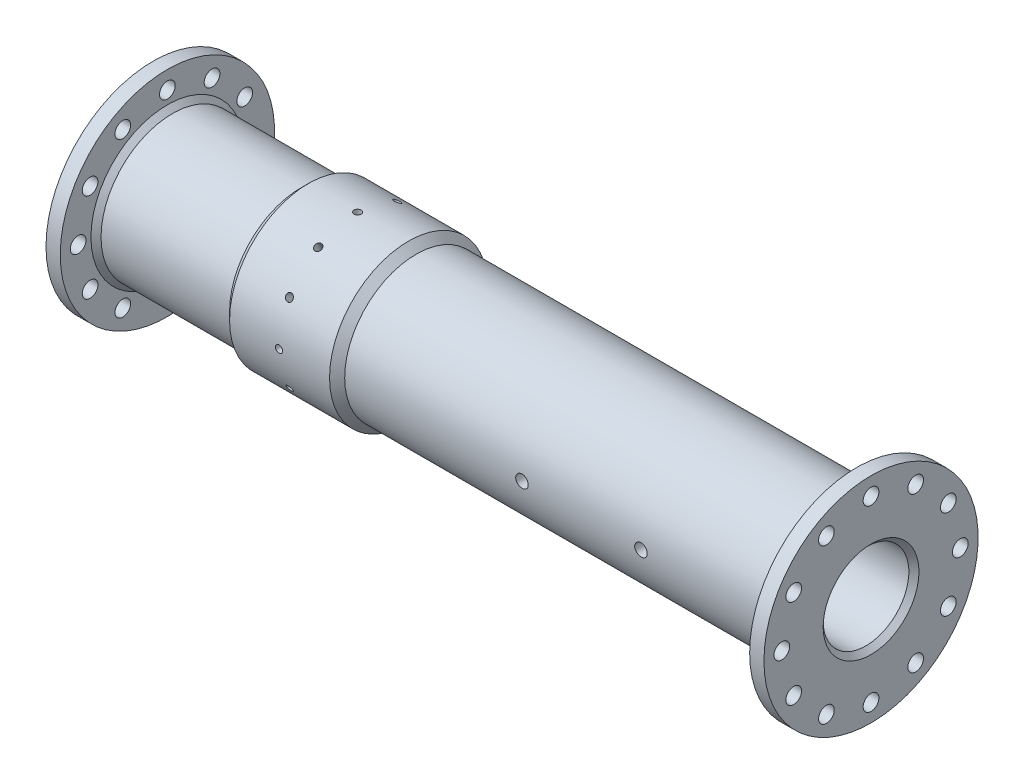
from build123d import *

# Parameters (mm, degrees)
M20_CLEARANCE_HOLE1_D                      = 22
CIRPATTERN1_COUNT                          = 12
F_10_0MM_DOWEL_HOLE1_REACH                 = 780.945
F_10_0MM_DOWEL_HOLE1_BORE_R                = 5
CIRPATTERN2_COUNT                          = 12
TAP_DRILL_FOR_M20X2_5_TAP1_REACH           = 684.255
TAP_DRILL_FOR_M20X2_5_TAP1_BORE_R          = 8.75
TAP_DRILL_FOR_M20X2_5_TAP1_ON_FACE_2_REACH = 837.883
TAP_DRILL_FOR_M20X2_5_TAP1_BORE_2_R        = 8.75


with BuildPart() as part:
    # Sketch1 → Revolve2 (revolve)
    with BuildSketch(Plane(origin=(0, 0, 0), x_dir=(1, 0, 0), z_dir=(0, 1, 0)), mode=Mode.PRIVATE) as revolve2_sk:
        with BuildLine():
            Line((0, 15.330989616), (20, 15.330989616))
            Line((20, 15.330989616), (20, -27.597942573))
            Line((20, -27.597942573), (27.071067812, -34.669010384))
            Line((27.071067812, -34.669010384), (207.071067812, -34.669010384))
            Line((207.071067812, -34.669010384), (217.67766953, -24.062408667))
            Line((217.67766953, -24.062408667), (357.67766953, -24.062408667))
            Line((357.67766953, -24.062408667), (368.284271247, -34.669010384))
            Line((368.284271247, -34.669010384), (978.284271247, -34.669010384))
            Line((978.284271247, -34.669010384), (985.355339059, -27.597942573))
            Line((985.355339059, -27.597942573), (985.355339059, 15.330989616))
            Line((985.355339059, 15.330989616), (1005.355339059, 15.330989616))
            Line((1005.355339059, 15.330989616), (1005.355339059, -67.597942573))
            Line((1005.355339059, -67.597942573), (998.284271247, -74.669010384))
            Line((998.284271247, -74.669010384), (750.395800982, -74.669010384))
            ThreePointArc((750.395800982, -74.669010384), (746.922837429, -74.972855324), (743.555398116, -75.875157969))
            Line((743.555398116, -75.875157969), (640.284027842, -113.4628628))
            ThreePointArc((640.284027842, -113.4628628), (636.916588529, -114.365165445), (633.443624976, -114.669010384))
            Line((633.443624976, -114.669010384), (600.496704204, -114.669010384))
            ThreePointArc((600.496704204, -114.669010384), (597.023740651, -114.365165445), (593.656301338, -113.4628628))
            Line((593.656301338, -113.4628628), (490.384931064, -75.875157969))
            ThreePointArc((490.384931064, -75.875157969), (487.017491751, -74.972855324), (483.544528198, -74.669010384))
            Line((483.544528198, -74.669010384), (7.071067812, -74.669010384))
            Line((7.071067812, -74.669010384), (0, -67.597942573))
            Line((0, -67.597942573), (0, 15.330989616))
        make_face()
    revolve(revolve2_sk.sketch.rotate(Axis((0, 0, 134.669010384), (1, 0, 0)), 180), axis=Axis((0, 0, 134.669010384), (1, 0, 0)))

    # M20 Clearance Hole1 (through all)
    with Locations(Plane.ZY):
        with Locations((134.669010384, 125)):
            m20_clearance_hole1 = Hole(M20_CLEARANCE_HOLE1_D / 2)

    # CirPattern1: M20 Clearance Hole1 ×12 about axis
    cirpattern1_axis = Axis((0, 0, 134.669010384), (1, 0, 0))
    for i in range(1, CIRPATTERN1_COUNT):
        add(m20_clearance_hole1.rotate(cirpattern1_axis, i * 360 / CIRPATTERN1_COUNT), mode=Mode.SUBTRACT)

    # 10.0mm Dowel Hole1 bore (on position points) → 10.0mm Dowel Hole1 (cut, up to next)
    with BuildSketch(Plane(origin=(286.882273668, -0.455264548, 245.274675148), x_dir=(0, 0.999991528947, 0.004116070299), z_dir=(0, -0.004116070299, 0.999991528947)), mode=Mode.PRIVATE) as f_10_0mm_dowel_hole1_sk1:
        Circle(F_10_0MM_DOWEL_HOLE1_BORE_R)
    f_10_0mm_dowel_hole1_tool1 = extrude(f_10_0mm_dowel_hole1_sk1.sketch, amount=-F_10_0MM_DOWEL_HOLE1_REACH, mode=Mode.PRIVATE) & part.part
    f_10_0mm_dowel_hole1 = f_10_0mm_dowel_hole1_tool1.solids().sort_by_distance((286.882274, -0.455265, 245.274675))[0]
    add(f_10_0mm_dowel_hole1, mode=Mode.SUBTRACT)

    # CirPattern2: 10.0mm Dowel Hole1 ×12 about axis
    cirpattern2_axis = Axis((217.67766953, 0, 134.669010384), (-1, 0, 0))
    for i in range(1, CIRPATTERN2_COUNT):
        add(f_10_0mm_dowel_hole1.rotate(cirpattern2_axis, i * 360 / CIRPATTERN2_COUNT), mode=Mode.SUBTRACT)

    # Tap Drill for M20x2.5 Tap1 bore (on position points) → Tap Drill for M20x2.5 Tap1 (cut, up to next)
    with BuildSketch(Plane(origin=(616.493806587, -1.365793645, 234.659682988), x_dir=(0, 0.999906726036, 0.013657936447), z_dir=(0, -0.013657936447, 0.999906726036)), mode=Mode.PRIVATE) as tap_drill_for_m20x2_5_tap1_sk1:
        Circle(TAP_DRILL_FOR_M20X2_5_TAP1_BORE_R)
    tap_drill_for_m20x2_5_tap1_tool1 = extrude(tap_drill_for_m20x2_5_tap1_sk1.sketch, amount=-TAP_DRILL_FOR_M20X2_5_TAP1_REACH, mode=Mode.PRIVATE) & part.part
    add(tap_drill_for_m20x2_5_tap1_tool1.solids().sort_by_distance((616.493807, -1.365794, 234.659683))[0], mode=Mode.SUBTRACT)

    # Tap Drill for M20x2.5 Tap1 bore 2 (on position points) → Tap Drill for M20x2.5 Tap1 on face 2 (cut, up to next)
    with BuildSketch(Plane(origin=(783.13058724, -1.365793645, 234.659682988), x_dir=(0, 0.999906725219, 0.013657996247), z_dir=(0, -0.013657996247, 0.999906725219)), mode=Mode.PRIVATE) as tap_drill_for_m20x2_5_tap1_on_face_2_sk1:
        Circle(TAP_DRILL_FOR_M20X2_5_TAP1_BORE_2_R)
    tap_drill_for_m20x2_5_tap1_on_face_2_tool1 = extrude(tap_drill_for_m20x2_5_tap1_on_face_2_sk1.sketch, amount=-TAP_DRILL_FOR_M20X2_5_TAP1_ON_FACE_2_REACH, mode=Mode.PRIVATE) & part.part
    add(tap_drill_for_m20x2_5_tap1_on_face_2_tool1.solids().sort_by_distance((783.130587, -1.365794, 234.659683))[0], mode=Mode.SUBTRACT)


solid = part.part
